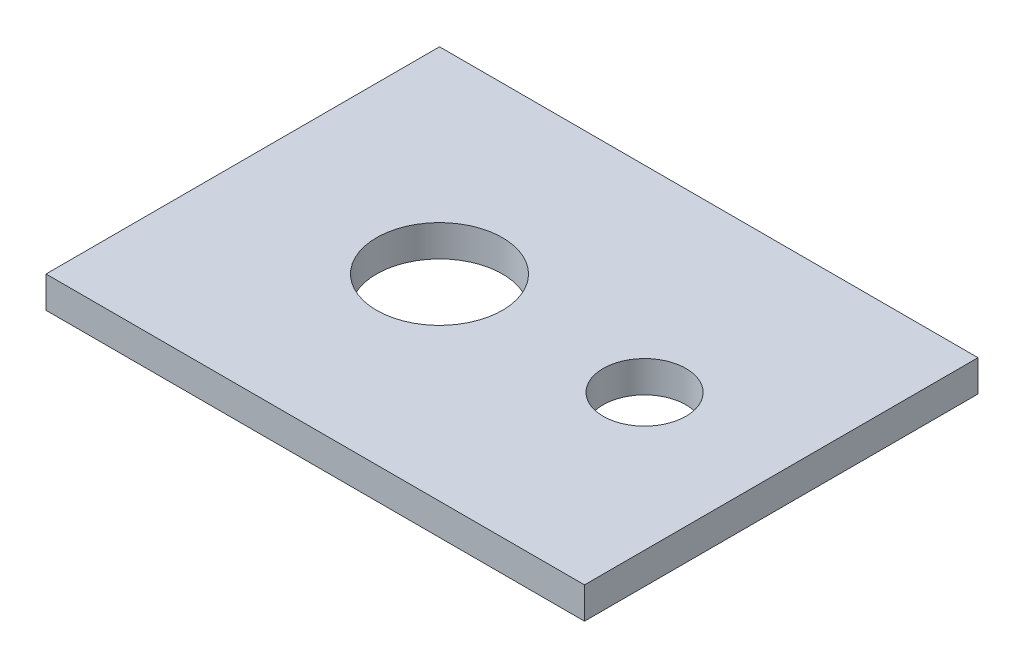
ISO-10303-21;
HEADER;
FILE_DESCRIPTION(('STEP AP214'),'2;1');
FILE_NAME('part.step','',(''),(''),'','','');
FILE_SCHEMA(('AUTOMOTIVE_DESIGN { 1 0 10303 214 1 1 1 1 }'));
ENDSEC;
DATA;
#1=APPLICATION_CONTEXT('core data for automotive mechanical design processes');
#2=APPLICATION_PROTOCOL_DEFINITION('international standard','automotive_design',2000,#1);
#3=PRODUCT_CONTEXT('',#1,'mechanical');
#4=PRODUCT('Part','Part','',(#3));
#5=PRODUCT_RELATED_PRODUCT_CATEGORY('part','',(#4));
#6=PRODUCT_DEFINITION_FORMATION('','',#4);
#7=PRODUCT_DEFINITION_CONTEXT('part definition',#1,'design');
#8=PRODUCT_DEFINITION('design','',#6,#7);
#9=PRODUCT_DEFINITION_SHAPE('','',#8);
#10=(LENGTH_UNIT() NAMED_UNIT(*) SI_UNIT(.MILLI.,.METRE.));
#11=(NAMED_UNIT(*) PLANE_ANGLE_UNIT() SI_UNIT($,.RADIAN.));
#12=(NAMED_UNIT(*) SI_UNIT($,.STERADIAN.) SOLID_ANGLE_UNIT());
#13=UNCERTAINTY_MEASURE_WITH_UNIT(LENGTH_MEASURE(1.E-05),#10,'distance_accuracy_value','');
#14=(GEOMETRIC_REPRESENTATION_CONTEXT(3) GLOBAL_UNCERTAINTY_ASSIGNED_CONTEXT((#13)) GLOBAL_UNIT_ASSIGNED_CONTEXT((#10,
#11,#12)) REPRESENTATION_CONTEXT('',''));
#15=CARTESIAN_POINT('',(0.,0.,0.));
#16=DIRECTION('',(0.,0.,1.));
#17=DIRECTION('',(1.,0.,0.));
#18=AXIS2_PLACEMENT_3D('',#15,#16,#17);
#19=CARTESIAN_POINT('',(0.,9.652,0.));
#20=DIRECTION('',(0.,1.,0.));
#21=DIRECTION('',(0.,0.,1.));
#22=AXIS2_PLACEMENT_3D('',#19,#20,#21);
#23=PLANE('',#22);
#24=CARTESIAN_POINT('',(60.325,9.652,-60.325));
#25=DIRECTION('',(0.,1.,0.));
#26=DIRECTION('',(0.,0.,1.));
#27=AXIS2_PLACEMENT_3D('',#24,#25,#26);
#28=CIRCLE('',#27,19.304);
#29=CARTESIAN_POINT('',(60.325,9.652,-41.021));
#30=VERTEX_POINT('',#29);
#31=EDGE_CURVE('E85',#30,#30,#28,.T.);
#32=ORIENTED_EDGE('',*,*,#31,.F.);
#33=EDGE_LOOP('',(#32));
#34=FACE_BOUND('',#33,.T.);
#35=DIRECTION('',(0.,0.,1.));
#36=VECTOR('',#35,1.);
#37=CARTESIAN_POINT('',(0.,9.652,0.));
#38=LINE('',#37,#36);
#39=CARTESIAN_POINT('',(0.,9.652,-120.65));
#40=VERTEX_POINT('',#39);
#41=CARTESIAN_POINT('',(0.,9.652,0.));
#42=VERTEX_POINT('',#41);
#43=EDGE_CURVE('E95',#40,#42,#38,.T.);
#44=ORIENTED_EDGE('',*,*,#43,.T.);
#45=DIRECTION('',(1.,0.,0.));
#46=VECTOR('',#45,1.);
#47=CARTESIAN_POINT('',(165.1,9.652,0.));
#48=LINE('',#47,#46);
#49=CARTESIAN_POINT('',(165.1,9.652,0.));
#50=VERTEX_POINT('',#49);
#51=EDGE_CURVE('E80',#42,#50,#48,.T.);
#52=ORIENTED_EDGE('',*,*,#51,.T.);
#53=DIRECTION('',(0.,0.,-1.));
#54=VECTOR('',#53,1.);
#55=CARTESIAN_POINT('',(165.1,9.652,-120.65));
#56=LINE('',#55,#54);
#57=CARTESIAN_POINT('',(165.1,9.652,-120.65));
#58=VERTEX_POINT('',#57);
#59=EDGE_CURVE('E46',#50,#58,#56,.T.);
#60=ORIENTED_EDGE('',*,*,#59,.T.);
#61=DIRECTION('',(-1.,0.,0.));
#62=VECTOR('',#61,1.);
#63=CARTESIAN_POINT('',(0.,9.652,-120.65));
#64=LINE('',#63,#62);
#65=EDGE_CURVE('E41',#58,#40,#64,.T.);
#66=ORIENTED_EDGE('',*,*,#65,.T.);
#67=EDGE_LOOP('',(#44,#52,#60,#66));
#68=FACE_BOUND('',#67,.T.);
#69=CARTESIAN_POINT('',(123.19,9.652,-60.325));
#70=DIRECTION('',(0.,1.,0.));
#71=DIRECTION('',(0.,0.,1.));
#72=AXIS2_PLACEMENT_3D('',#69,#70,#71);
#73=CIRCLE('',#72,12.7);
#74=CARTESIAN_POINT('',(123.19,9.652,-47.625));
#75=VERTEX_POINT('',#74);
#76=EDGE_CURVE('E113',#75,#75,#73,.T.);
#77=ORIENTED_EDGE('',*,*,#76,.F.);
#78=EDGE_LOOP('',(#77));
#79=FACE_BOUND('',#78,.T.);
#80=ADVANCED_FACE('F26',(#34,#68,#79),#23,.T.);
#81=CARTESIAN_POINT('',(0.,0.,0.));
#82=DIRECTION('',(0.,1.,0.));
#83=DIRECTION('',(0.,0.,1.));
#84=AXIS2_PLACEMENT_3D('',#81,#82,#83);
#85=PLANE('',#84);
#86=CARTESIAN_POINT('',(60.325,0.,-60.325));
#87=DIRECTION('',(0.,1.,0.));
#88=DIRECTION('',(0.,0.,1.));
#89=AXIS2_PLACEMENT_3D('',#86,#87,#88);
#90=CIRCLE('',#89,19.304);
#91=CARTESIAN_POINT('',(60.325,0.,-41.021));
#92=VERTEX_POINT('',#91);
#93=EDGE_CURVE('E88',#92,#92,#90,.T.);
#94=ORIENTED_EDGE('',*,*,#93,.T.);
#95=EDGE_LOOP('',(#94));
#96=FACE_BOUND('',#95,.T.);
#97=DIRECTION('',(0.,0.,1.));
#98=VECTOR('',#97,1.);
#99=CARTESIAN_POINT('',(0.,0.,0.));
#100=LINE('',#99,#98);
#101=CARTESIAN_POINT('',(0.,0.,-120.65));
#102=VERTEX_POINT('',#101);
#103=CARTESIAN_POINT('',(0.,0.,0.));
#104=VERTEX_POINT('',#103);
#105=EDGE_CURVE('E72',#102,#104,#100,.T.);
#106=ORIENTED_EDGE('',*,*,#105,.F.);
#107=DIRECTION('',(-1.,0.,0.));
#108=VECTOR('',#107,1.);
#109=CARTESIAN_POINT('',(0.,0.,-120.65));
#110=LINE('',#109,#108);
#111=CARTESIAN_POINT('',(165.1,0.,-120.65));
#112=VERTEX_POINT('',#111);
#113=EDGE_CURVE('E93',#112,#102,#110,.T.);
#114=ORIENTED_EDGE('',*,*,#113,.F.);
#115=DIRECTION('',(0.,0.,-1.));
#116=VECTOR('',#115,1.);
#117=CARTESIAN_POINT('',(165.1,0.,-120.65));
#118=LINE('',#117,#116);
#119=CARTESIAN_POINT('',(165.1,0.,0.));
#120=VERTEX_POINT('',#119);
#121=EDGE_CURVE('E73',#120,#112,#118,.T.);
#122=ORIENTED_EDGE('',*,*,#121,.F.);
#123=DIRECTION('',(1.,0.,0.));
#124=VECTOR('',#123,1.);
#125=CARTESIAN_POINT('',(165.1,0.,0.));
#126=LINE('',#125,#124);
#127=EDGE_CURVE('E67',#104,#120,#126,.T.);
#128=ORIENTED_EDGE('',*,*,#127,.F.);
#129=EDGE_LOOP('',(#106,#114,#122,#128));
#130=FACE_BOUND('',#129,.T.);
#131=CARTESIAN_POINT('',(123.19,0.,-60.325));
#132=DIRECTION('',(0.,1.,0.));
#133=DIRECTION('',(0.,0.,1.));
#134=AXIS2_PLACEMENT_3D('',#131,#132,#133);
#135=CIRCLE('',#134,12.7);
#136=CARTESIAN_POINT('',(123.19,0.,-47.625));
#137=VERTEX_POINT('',#136);
#138=EDGE_CURVE('E115',#137,#137,#135,.T.);
#139=ORIENTED_EDGE('',*,*,#138,.T.);
#140=EDGE_LOOP('',(#139));
#141=FACE_BOUND('',#140,.T.);
#142=ADVANCED_FACE('F68',(#96,#130,#141),#85,.F.);
#143=CARTESIAN_POINT('',(0.,9.652,0.));
#144=DIRECTION('',(1.,0.,0.));
#145=DIRECTION('',(0.,0.,-1.));
#146=AXIS2_PLACEMENT_3D('',#143,#144,#145);
#147=PLANE('',#146);
#148=ORIENTED_EDGE('',*,*,#105,.T.);
#149=DIRECTION('',(0.,-1.,0.));
#150=VECTOR('',#149,1.);
#151=CARTESIAN_POINT('',(0.,9.652,0.));
#152=LINE('',#151,#150);
#153=EDGE_CURVE('E11',#42,#104,#152,.T.);
#154=ORIENTED_EDGE('',*,*,#153,.F.);
#155=ORIENTED_EDGE('',*,*,#43,.F.);
#156=DIRECTION('',(0.,-1.,0.));
#157=VECTOR('',#156,1.);
#158=CARTESIAN_POINT('',(0.,9.652,-120.65));
#159=LINE('',#158,#157);
#160=EDGE_CURVE('E84',#40,#102,#159,.T.);
#161=ORIENTED_EDGE('',*,*,#160,.T.);
#162=EDGE_LOOP('',(#148,#154,#155,#161));
#163=FACE_BOUND('',#162,.T.);
#164=ADVANCED_FACE('F28',(#163),#147,.F.);
#165=CARTESIAN_POINT('',(165.1,9.652,0.));
#166=DIRECTION('',(0.,0.,-1.));
#167=DIRECTION('',(-1.,0.,0.));
#168=AXIS2_PLACEMENT_3D('',#165,#166,#167);
#169=PLANE('',#168);
#170=ORIENTED_EDGE('',*,*,#127,.T.);
#171=DIRECTION('',(0.,-1.,0.));
#172=VECTOR('',#171,1.);
#173=CARTESIAN_POINT('',(165.1,9.652,0.));
#174=LINE('',#173,#172);
#175=EDGE_CURVE('E34',#50,#120,#174,.T.);
#176=ORIENTED_EDGE('',*,*,#175,.F.);
#177=ORIENTED_EDGE('',*,*,#51,.F.);
#178=ORIENTED_EDGE('',*,*,#153,.T.);
#179=EDGE_LOOP('',(#170,#176,#177,#178));
#180=FACE_BOUND('',#179,.T.);
#181=ADVANCED_FACE('F79',(#180),#169,.F.);
#182=CARTESIAN_POINT('',(165.1,9.652,-120.65));
#183=DIRECTION('',(-1.,0.,0.));
#184=DIRECTION('',(0.,0.,1.));
#185=AXIS2_PLACEMENT_3D('',#182,#183,#184);
#186=PLANE('',#185);
#187=ORIENTED_EDGE('',*,*,#121,.T.);
#188=DIRECTION('',(0.,-1.,0.));
#189=VECTOR('',#188,1.);
#190=CARTESIAN_POINT('',(165.1,9.652,-120.65));
#191=LINE('',#190,#189);
#192=EDGE_CURVE('E101',#58,#112,#191,.T.);
#193=ORIENTED_EDGE('',*,*,#192,.F.);
#194=ORIENTED_EDGE('',*,*,#59,.F.);
#195=ORIENTED_EDGE('',*,*,#175,.T.);
#196=EDGE_LOOP('',(#187,#193,#194,#195));
#197=FACE_BOUND('',#196,.T.);
#198=ADVANCED_FACE('F104',(#197),#186,.F.);
#199=CARTESIAN_POINT('',(0.,9.652,-120.65));
#200=DIRECTION('',(0.,0.,1.));
#201=DIRECTION('',(1.,0.,0.));
#202=AXIS2_PLACEMENT_3D('',#199,#200,#201);
#203=PLANE('',#202);
#204=ORIENTED_EDGE('',*,*,#113,.T.);
#205=ORIENTED_EDGE('',*,*,#160,.F.);
#206=ORIENTED_EDGE('',*,*,#65,.F.);
#207=ORIENTED_EDGE('',*,*,#192,.T.);
#208=EDGE_LOOP('',(#204,#205,#206,#207));
#209=FACE_BOUND('',#208,.T.);
#210=ADVANCED_FACE('F106',(#209),#203,.F.);
#211=CARTESIAN_POINT('',(60.325,9.652,-60.325));
#212=DIRECTION('',(0.,-1.,0.));
#213=DIRECTION('',(0.,0.,-1.));
#214=AXIS2_PLACEMENT_3D('',#211,#212,#213);
#215=CYLINDRICAL_SURFACE('',#214,19.304);
#216=ORIENTED_EDGE('',*,*,#31,.T.);
#217=EDGE_LOOP('',(#216));
#218=FACE_BOUND('',#217,.T.);
#219=ORIENTED_EDGE('',*,*,#93,.F.);
#220=EDGE_LOOP('',(#219));
#221=FACE_BOUND('',#220,.T.);
#222=ADVANCED_FACE('F124',(#218,#221),#215,.F.);
#223=CARTESIAN_POINT('',(123.19,9.652,-60.325));
#224=DIRECTION('',(0.,-1.,0.));
#225=DIRECTION('',(0.,0.,-1.));
#226=AXIS2_PLACEMENT_3D('',#223,#224,#225);
#227=CYLINDRICAL_SURFACE('',#226,12.7);
#228=ORIENTED_EDGE('',*,*,#76,.T.);
#229=EDGE_LOOP('',(#228));
#230=FACE_BOUND('',#229,.T.);
#231=ORIENTED_EDGE('',*,*,#138,.F.);
#232=EDGE_LOOP('',(#231));
#233=FACE_BOUND('',#232,.T.);
#234=ADVANCED_FACE('F122',(#230,#233),#227,.F.);
#235=CLOSED_SHELL('',(#80,#142,#164,#181,#198,#210,#222,#234));
#236=MANIFOLD_SOLID_BREP('B2',#235);
#237=ADVANCED_BREP_SHAPE_REPRESENTATION('',(#18,#236),#14);
#238=SHAPE_DEFINITION_REPRESENTATION(#9,#237);
ENDSEC;
END-ISO-10303-21;
